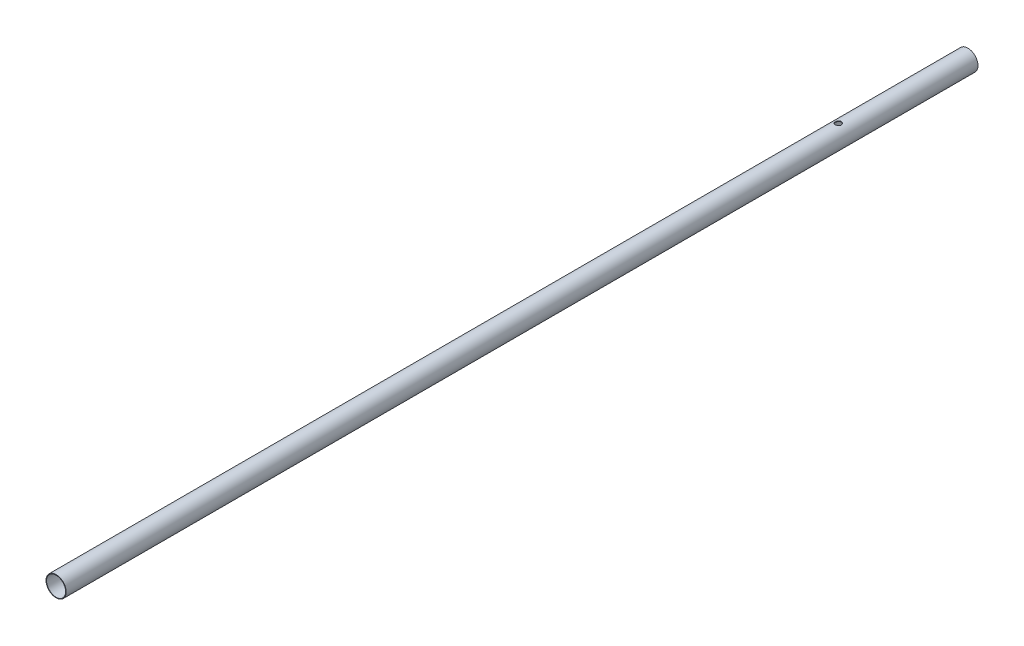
ISO-10303-21;
HEADER;
FILE_DESCRIPTION(('STEP AP214'),'2;1');
FILE_NAME('part.step','',(''),(''),'','','');
FILE_SCHEMA(('AUTOMOTIVE_DESIGN { 1 0 10303 214 1 1 1 1 }'));
ENDSEC;
DATA;
#1=APPLICATION_CONTEXT('core data for automotive mechanical design processes');
#2=APPLICATION_PROTOCOL_DEFINITION('international standard','automotive_design',2000,#1);
#3=PRODUCT_CONTEXT('',#1,'mechanical');
#4=PRODUCT('Part','Part','',(#3));
#5=PRODUCT_RELATED_PRODUCT_CATEGORY('part','',(#4));
#6=PRODUCT_DEFINITION_FORMATION('','',#4);
#7=PRODUCT_DEFINITION_CONTEXT('part definition',#1,'design');
#8=PRODUCT_DEFINITION('design','',#6,#7);
#9=PRODUCT_DEFINITION_SHAPE('','',#8);
#10=(LENGTH_UNIT() NAMED_UNIT(*) SI_UNIT(.MILLI.,.METRE.));
#11=(NAMED_UNIT(*) PLANE_ANGLE_UNIT() SI_UNIT($,.RADIAN.));
#12=(NAMED_UNIT(*) SI_UNIT($,.STERADIAN.) SOLID_ANGLE_UNIT());
#13=UNCERTAINTY_MEASURE_WITH_UNIT(LENGTH_MEASURE(1.E-05),#10,'distance_accuracy_value','');
#14=(GEOMETRIC_REPRESENTATION_CONTEXT(3) GLOBAL_UNCERTAINTY_ASSIGNED_CONTEXT((#13)) GLOBAL_UNIT_ASSIGNED_CONTEXT((#10,
#11,#12)) REPRESENTATION_CONTEXT('',''));
#15=CARTESIAN_POINT('',(0.,0.,0.));
#16=DIRECTION('',(0.,0.,1.));
#17=DIRECTION('',(1.,0.,0.));
#18=AXIS2_PLACEMENT_3D('',#15,#16,#17);
#19=CARTESIAN_POINT('',(0.,0.,1532.));
#20=DIRECTION('',(0.,0.,-1.));
#21=DIRECTION('',(-1.,0.,0.));
#22=AXIS2_PLACEMENT_3D('',#19,#20,#21);
#23=CYLINDRICAL_SURFACE('',#22,17.);
#24=CARTESIAN_POINT('',(0.,-17.,223.));
#25=CARTESIAN_POINT('',(0.274542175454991,-16.9999972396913,222.999996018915));
#26=CARTESIAN_POINT('',(0.549124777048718,-16.9932854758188,222.977312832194));
#27=CARTESIAN_POINT('',(1.09030958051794,-16.9671658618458,222.887384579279));
#28=CARTESIAN_POINT('',(1.35690910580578,-16.9477538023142,222.820124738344));
#29=CARTESIAN_POINT('',(1.87424279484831,-16.8983635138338,222.643471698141));
#30=CARTESIAN_POINT('',(2.12499922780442,-16.8684005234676,222.534139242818));
#31=CARTESIAN_POINT('',(2.60462027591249,-16.8010321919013,222.276689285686));
#32=CARTESIAN_POINT('',(2.83348222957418,-16.7636259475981,222.128567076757));
#33=CARTESIAN_POINT('',(3.26915832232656,-16.6842112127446,221.793416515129));
#34=CARTESIAN_POINT('',(3.47528005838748,-16.6421111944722,221.605509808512));
#35=CARTESIAN_POINT('',(3.85358695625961,-16.558607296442,221.197997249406));
#36=CARTESIAN_POINT('',(4.02576667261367,-16.5172035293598,220.978386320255));
#37=CARTESIAN_POINT('',(4.33489560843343,-16.4388177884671,220.507902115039));
#38=CARTESIAN_POINT('',(4.47100870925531,-16.4019498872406,220.256458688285));
#39=CARTESIAN_POINT('',(4.69873934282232,-16.3381741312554,219.732992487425));
#40=CARTESIAN_POINT('',(4.79036709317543,-16.3112639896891,219.460974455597));
#41=CARTESIAN_POINT('',(4.92404618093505,-16.2714028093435,218.911837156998));
#42=CARTESIAN_POINT('',(4.96737026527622,-16.2580942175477,218.635054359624));
#43=CARTESIAN_POINT('',(5.0071854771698,-16.245878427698,218.077853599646));
#44=CARTESIAN_POINT('',(5.00368745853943,-16.2469678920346,217.797436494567));
#45=CARTESIAN_POINT('',(4.95095940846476,-16.2631076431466,217.251198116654));
#46=CARTESIAN_POINT('',(4.90331354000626,-16.2776742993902,216.985207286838));
#47=CARTESIAN_POINT('',(4.76619765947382,-16.3183462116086,216.465174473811));
#48=CARTESIAN_POINT('',(4.67672366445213,-16.3444525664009,216.211133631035));
#49=CARTESIAN_POINT('',(4.45730211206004,-16.4056554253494,215.718290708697));
#50=CARTESIAN_POINT('',(4.32683320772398,-16.4408666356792,215.479735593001));
#51=CARTESIAN_POINT('',(4.02948792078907,-16.5162554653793,215.02736924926));
#52=CARTESIAN_POINT('',(3.86260301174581,-16.5564342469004,214.813563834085));
#53=CARTESIAN_POINT('',(3.48925235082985,-16.6392021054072,214.407768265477));
#54=CARTESIAN_POINT('',(3.28146894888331,-16.6818232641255,214.216994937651));
#55=CARTESIAN_POINT('',(2.83632910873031,-16.7632443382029,213.87272397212));
#56=CARTESIAN_POINT('',(2.59897095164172,-16.8020440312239,213.719228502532));
#57=CARTESIAN_POINT('',(2.09926848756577,-16.8717818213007,213.453169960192));
#58=CARTESIAN_POINT('',(1.83677785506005,-16.9026694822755,213.340867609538));
#59=CARTESIAN_POINT('',(1.29551766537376,-16.9527396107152,213.16235794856));
#60=CARTESIAN_POINT('',(1.01675248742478,-16.9719252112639,213.096138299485));
#61=CARTESIAN_POINT('',(0.461208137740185,-16.9959379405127,213.013678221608));
#62=CARTESIAN_POINT('',(0.184693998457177,-17.0012389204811,212.995787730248));
#63=CARTESIAN_POINT('',(-0.367399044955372,-16.9982701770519,213.005881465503));
#64=CARTESIAN_POINT('',(-0.642978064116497,-16.9900021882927,213.033859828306));
#65=CARTESIAN_POINT('',(-1.17921271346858,-16.961134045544,213.1335588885));
#66=CARTESIAN_POINT('',(-1.44006199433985,-16.9408036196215,213.204323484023));
#67=CARTESIAN_POINT('',(-1.9461351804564,-16.8901536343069,213.386443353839));
#68=CARTESIAN_POINT('',(-2.19135723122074,-16.8598328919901,213.497803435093));
#69=CARTESIAN_POINT('',(-2.66534944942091,-16.7915033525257,213.760775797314));
#70=CARTESIAN_POINT('',(-2.89362448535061,-16.7533367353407,213.913238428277));
#71=CARTESIAN_POINT('',(-3.32191560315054,-16.673704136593,214.253048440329));
#72=CARTESIAN_POINT('',(-3.52192485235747,-16.6322373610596,214.440404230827));
#73=CARTESIAN_POINT('',(-3.89521688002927,-16.5488725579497,214.852428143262));
#74=CARTESIAN_POINT('',(-4.06732704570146,-16.5070097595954,215.078168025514));
#75=CARTESIAN_POINT('',(-4.37129517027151,-16.4291353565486,215.556232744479));
#76=CARTESIAN_POINT('',(-4.50315434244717,-16.3931235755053,215.808556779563));
#77=CARTESIAN_POINT('',(-4.72194711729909,-16.3314467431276,216.331714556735));
#78=CARTESIAN_POINT('',(-4.80910325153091,-16.3057305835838,216.60244886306));
#79=CARTESIAN_POINT('',(-4.93634927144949,-16.26766584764,217.155642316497));
#80=CARTESIAN_POINT('',(-4.97645449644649,-16.2553129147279,217.438097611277));
#81=CARTESIAN_POINT('',(-5.00744547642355,-16.2457908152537,217.994567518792));
#82=CARTESIAN_POINT('',(-5.00023747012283,-16.2480335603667,218.268467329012));
#83=CARTESIAN_POINT('',(-4.94133317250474,-16.2660429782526,218.810964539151));
#84=CARTESIAN_POINT('',(-4.88963853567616,-16.2818091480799,219.079562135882));
#85=CARTESIAN_POINT('',(-4.74443717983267,-16.3247022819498,219.600847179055));
#86=CARTESIAN_POINT('',(-4.65141659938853,-16.3516969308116,219.853681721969));
#87=CARTESIAN_POINT('',(-4.42658103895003,-16.413985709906,220.340356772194));
#88=CARTESIAN_POINT('',(-4.2947588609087,-16.4492813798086,220.574193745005));
#89=CARTESIAN_POINT('',(-3.99063021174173,-16.525744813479,221.025129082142));
#90=CARTESIAN_POINT('',(-3.81706300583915,-16.5670754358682,221.241349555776));
#91=CARTESIAN_POINT('',(-3.43666397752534,-16.6501406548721,221.642213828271));
#92=CARTESIAN_POINT('',(-3.22982363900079,-16.6918753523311,221.826849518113));
#93=CARTESIAN_POINT('',(-2.78184131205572,-16.7724327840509,222.164392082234));
#94=CARTESIAN_POINT('',(-2.53990743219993,-16.8111427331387,222.316277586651));
#95=CARTESIAN_POINT('',(-2.03279874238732,-16.8799593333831,222.576998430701));
#96=CARTESIAN_POINT('',(-1.76763565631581,-16.9100702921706,222.685855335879));
#97=CARTESIAN_POINT('',(-1.25377523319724,-16.9554297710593,222.846835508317));
#98=CARTESIAN_POINT('',(-1.00680227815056,-16.97200860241,222.90412084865));
#99=CARTESIAN_POINT('',(-0.506563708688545,-16.9942941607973,222.980702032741));
#100=CARTESIAN_POINT('',(-0.253299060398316,-17.0000025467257,223.000003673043));
#101=CARTESIAN_POINT('',(0.,-17.,223.));
#102=B_SPLINE_CURVE_WITH_KNOTS('',3,(#24,#25,#26,#27,#28,#29,#30,#31,#32,#33,#34,#35,#36,#37,
#38,#39,#40,#41,#42,#43,#44,#45,#46,#47,#48,#49,#50,#51,#52,#53,#54,#55,#56,#57,#58,#59,#60,#61,
#62,#63,#64,#65,#66,#67,#68,#69,#70,#71,#72,#73,#74,#75,#76,#77,#78,#79,#80,#81,#82,#83,#84,#85,
#86,#87,#88,#89,#90,#91,#92,#93,#94,#95,#96,#97,#98,#99,#100,#101),.UNSPECIFIED.,.T.,.F.,(4,2,2,
2,2,2,2,2,2,2,2,2,2,2,2,2,2,2,2,2,2,2,2,2,2,2,2,2,2,2,2,2,2,2,2,2,2,2,4),(0.,0.822696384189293,
1.64566558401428,2.46745102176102,3.28933622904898,4.13172361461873,4.97424603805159,
5.83486437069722,6.69528493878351,7.53245524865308,8.36943149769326,9.17749119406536,
9.98562785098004,10.8044888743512,11.623541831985,12.4754016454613,13.3273109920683,
14.18452287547,15.0415051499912,15.8688347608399,16.6960586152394,17.5054473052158,
18.3149318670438,19.1426539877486,19.9705758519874,20.8273157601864,21.6840298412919,
22.5364367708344,23.3885657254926,24.2065793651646,25.024562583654,25.8331682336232,
26.6419239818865,27.4791225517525,28.3165357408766,29.1771614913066,30.0373553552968,
30.7965102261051,31.5555492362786),.UNSPECIFIED.);
#103=CARTESIAN_POINT('',(0.,-17.,223.));
#104=VERTEX_POINT('',#103);
#105=EDGE_CURVE('E72',#104,#104,#102,.T.);
#106=ORIENTED_EDGE('',*,*,#105,.T.);
#107=EDGE_LOOP('',(#106));
#108=FACE_BOUND('',#107,.T.);
#109=CARTESIAN_POINT('',(0.,17.,223.));
#110=CARTESIAN_POINT('',(-0.274542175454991,16.9999972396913,222.999996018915));
#111=CARTESIAN_POINT('',(-0.549124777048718,16.9932854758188,222.977312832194));
#112=CARTESIAN_POINT('',(-1.09030958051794,16.9671658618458,222.887384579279));
#113=CARTESIAN_POINT('',(-1.35690910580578,16.9477538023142,222.820124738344));
#114=CARTESIAN_POINT('',(-1.87424279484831,16.8983635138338,222.643471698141));
#115=CARTESIAN_POINT('',(-2.12499922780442,16.8684005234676,222.534139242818));
#116=CARTESIAN_POINT('',(-2.60462027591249,16.8010321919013,222.276689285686));
#117=CARTESIAN_POINT('',(-2.83348222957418,16.7636259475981,222.128567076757));
#118=CARTESIAN_POINT('',(-3.26915832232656,16.6842112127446,221.793416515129));
#119=CARTESIAN_POINT('',(-3.47528005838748,16.6421111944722,221.605509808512));
#120=CARTESIAN_POINT('',(-3.85358695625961,16.558607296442,221.197997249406));
#121=CARTESIAN_POINT('',(-4.02576667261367,16.5172035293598,220.978386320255));
#122=CARTESIAN_POINT('',(-4.33489560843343,16.4388177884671,220.507902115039));
#123=CARTESIAN_POINT('',(-4.47100870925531,16.4019498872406,220.256458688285));
#124=CARTESIAN_POINT('',(-4.69873934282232,16.3381741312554,219.732992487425));
#125=CARTESIAN_POINT('',(-4.79036709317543,16.3112639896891,219.460974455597));
#126=CARTESIAN_POINT('',(-4.92404618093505,16.2714028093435,218.911837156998));
#127=CARTESIAN_POINT('',(-4.96737026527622,16.2580942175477,218.635054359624));
#128=CARTESIAN_POINT('',(-5.0071854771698,16.245878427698,218.077853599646));
#129=CARTESIAN_POINT('',(-5.00368745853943,16.2469678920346,217.797436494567));
#130=CARTESIAN_POINT('',(-4.95095940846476,16.2631076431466,217.251198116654));
#131=CARTESIAN_POINT('',(-4.90331354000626,16.2776742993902,216.985207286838));
#132=CARTESIAN_POINT('',(-4.76619765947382,16.3183462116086,216.465174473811));
#133=CARTESIAN_POINT('',(-4.67672366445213,16.3444525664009,216.211133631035));
#134=CARTESIAN_POINT('',(-4.45730211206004,16.4056554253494,215.718290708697));
#135=CARTESIAN_POINT('',(-4.32683320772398,16.4408666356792,215.479735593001));
#136=CARTESIAN_POINT('',(-4.02948792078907,16.5162554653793,215.02736924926));
#137=CARTESIAN_POINT('',(-3.86260301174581,16.5564342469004,214.813563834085));
#138=CARTESIAN_POINT('',(-3.48925235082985,16.6392021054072,214.407768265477));
#139=CARTESIAN_POINT('',(-3.28146894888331,16.6818232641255,214.216994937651));
#140=CARTESIAN_POINT('',(-2.83632910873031,16.7632443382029,213.87272397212));
#141=CARTESIAN_POINT('',(-2.59897095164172,16.8020440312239,213.719228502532));
#142=CARTESIAN_POINT('',(-2.09926848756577,16.8717818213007,213.453169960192));
#143=CARTESIAN_POINT('',(-1.83677785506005,16.9026694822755,213.340867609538));
#144=CARTESIAN_POINT('',(-1.29551766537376,16.9527396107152,213.16235794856));
#145=CARTESIAN_POINT('',(-1.01675248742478,16.9719252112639,213.096138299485));
#146=CARTESIAN_POINT('',(-0.461208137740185,16.9959379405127,213.013678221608));
#147=CARTESIAN_POINT('',(-0.184693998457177,17.0012389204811,212.995787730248));
#148=CARTESIAN_POINT('',(0.367399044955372,16.9982701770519,213.005881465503));
#149=CARTESIAN_POINT('',(0.642978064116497,16.9900021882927,213.033859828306));
#150=CARTESIAN_POINT('',(1.17921271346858,16.961134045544,213.1335588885));
#151=CARTESIAN_POINT('',(1.44006199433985,16.9408036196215,213.204323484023));
#152=CARTESIAN_POINT('',(1.9461351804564,16.8901536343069,213.386443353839));
#153=CARTESIAN_POINT('',(2.19135723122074,16.8598328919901,213.497803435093));
#154=CARTESIAN_POINT('',(2.66534944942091,16.7915033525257,213.760775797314));
#155=CARTESIAN_POINT('',(2.89362448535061,16.7533367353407,213.913238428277));
#156=CARTESIAN_POINT('',(3.32191560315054,16.673704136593,214.253048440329));
#157=CARTESIAN_POINT('',(3.52192485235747,16.6322373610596,214.440404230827));
#158=CARTESIAN_POINT('',(3.89521688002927,16.5488725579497,214.852428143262));
#159=CARTESIAN_POINT('',(4.06732704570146,16.5070097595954,215.078168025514));
#160=CARTESIAN_POINT('',(4.37129517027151,16.4291353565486,215.556232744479));
#161=CARTESIAN_POINT('',(4.50315434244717,16.3931235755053,215.808556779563));
#162=CARTESIAN_POINT('',(4.72194711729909,16.3314467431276,216.331714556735));
#163=CARTESIAN_POINT('',(4.80910325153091,16.3057305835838,216.60244886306));
#164=CARTESIAN_POINT('',(4.93634927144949,16.26766584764,217.155642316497));
#165=CARTESIAN_POINT('',(4.97645449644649,16.2553129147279,217.438097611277));
#166=CARTESIAN_POINT('',(5.00744547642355,16.2457908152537,217.994567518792));
#167=CARTESIAN_POINT('',(5.00023747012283,16.2480335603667,218.268467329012));
#168=CARTESIAN_POINT('',(4.94133317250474,16.2660429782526,218.810964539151));
#169=CARTESIAN_POINT('',(4.88963853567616,16.2818091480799,219.079562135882));
#170=CARTESIAN_POINT('',(4.74443717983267,16.3247022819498,219.600847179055));
#171=CARTESIAN_POINT('',(4.65141659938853,16.3516969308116,219.853681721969));
#172=CARTESIAN_POINT('',(4.42658103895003,16.413985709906,220.340356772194));
#173=CARTESIAN_POINT('',(4.2947588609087,16.4492813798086,220.574193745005));
#174=CARTESIAN_POINT('',(3.99063021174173,16.525744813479,221.025129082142));
#175=CARTESIAN_POINT('',(3.81706300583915,16.5670754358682,221.241349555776));
#176=CARTESIAN_POINT('',(3.43666397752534,16.6501406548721,221.642213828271));
#177=CARTESIAN_POINT('',(3.22982363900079,16.6918753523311,221.826849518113));
#178=CARTESIAN_POINT('',(2.78184131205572,16.7724327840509,222.164392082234));
#179=CARTESIAN_POINT('',(2.53990743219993,16.8111427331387,222.316277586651));
#180=CARTESIAN_POINT('',(2.03279874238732,16.8799593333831,222.576998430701));
#181=CARTESIAN_POINT('',(1.76763565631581,16.9100702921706,222.685855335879));
#182=CARTESIAN_POINT('',(1.25377523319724,16.9554297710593,222.846835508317));
#183=CARTESIAN_POINT('',(1.00680227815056,16.97200860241,222.90412084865));
#184=CARTESIAN_POINT('',(0.506563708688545,16.9942941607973,222.980702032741));
#185=CARTESIAN_POINT('',(0.253299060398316,17.0000025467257,223.000003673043));
#186=CARTESIAN_POINT('',(0.,17.,223.));
#187=B_SPLINE_CURVE_WITH_KNOTS('',3,(#109,#110,#111,#112,#113,#114,#115,#116,#117,#118,#119,
#120,#121,#122,#123,#124,#125,#126,#127,#128,#129,#130,#131,#132,#133,#134,#135,#136,#137,#138,
#139,#140,#141,#142,#143,#144,#145,#146,#147,#148,#149,#150,#151,#152,#153,#154,#155,#156,#157,
#158,#159,#160,#161,#162,#163,#164,#165,#166,#167,#168,#169,#170,#171,#172,#173,#174,#175,#176,
#177,#178,#179,#180,#181,#182,#183,#184,#185,#186),.UNSPECIFIED.,.T.,.F.,(4,2,2,2,2,2,2,2,2,2,2,
2,2,2,2,2,2,2,2,2,2,2,2,2,2,2,2,2,2,2,2,2,2,2,2,2,2,2,4),(0.,0.822696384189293,1.64566558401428,
2.46745102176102,3.28933622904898,4.13172361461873,4.97424603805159,5.83486437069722,
6.69528493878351,7.53245524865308,8.36943149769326,9.17749119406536,9.98562785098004,
10.8044888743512,11.623541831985,12.4754016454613,13.3273109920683,14.18452287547,
15.0415051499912,15.8688347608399,16.6960586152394,17.5054473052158,18.3149318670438,
19.1426539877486,19.9705758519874,20.8273157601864,21.6840298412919,22.5364367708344,
23.3885657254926,24.2065793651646,25.024562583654,25.8331682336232,26.6419239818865,
27.4791225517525,28.3165357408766,29.1771614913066,30.0373553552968,30.7965102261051,
31.5555492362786),.UNSPECIFIED.);
#188=CARTESIAN_POINT('',(0.,17.,223.));
#189=VERTEX_POINT('',#188);
#190=EDGE_CURVE('E68',#189,#189,#187,.T.);
#191=ORIENTED_EDGE('',*,*,#190,.T.);
#192=EDGE_LOOP('',(#191));
#193=FACE_BOUND('',#192,.T.);
#194=CARTESIAN_POINT('',(0.,0.,1532.));
#195=DIRECTION('',(0.,0.,1.));
#196=DIRECTION('',(1.,0.,0.));
#197=AXIS2_PLACEMENT_3D('',#194,#195,#196);
#198=CIRCLE('',#197,17.);
#199=CARTESIAN_POINT('',(17.,0.,1532.));
#200=VERTEX_POINT('',#199);
#201=EDGE_CURVE('E10',#200,#200,#198,.T.);
#202=ORIENTED_EDGE('',*,*,#201,.F.);
#203=EDGE_LOOP('',(#202));
#204=FACE_BOUND('',#203,.T.);
#205=CARTESIAN_POINT('',(0.,0.,0.));
#206=DIRECTION('',(0.,0.,1.));
#207=DIRECTION('',(1.,0.,0.));
#208=AXIS2_PLACEMENT_3D('',#205,#206,#207);
#209=CIRCLE('',#208,17.);
#210=CARTESIAN_POINT('',(17.,0.,0.));
#211=VERTEX_POINT('',#210);
#212=EDGE_CURVE('E41',#211,#211,#209,.T.);
#213=ORIENTED_EDGE('',*,*,#212,.T.);
#214=EDGE_LOOP('',(#213));
#215=FACE_BOUND('',#214,.T.);
#216=ADVANCED_FACE('F29',(#108,#193,#204,#215),#23,.T.);
#217=CARTESIAN_POINT('',(0.,0.,1532.));
#218=DIRECTION('',(0.,0.,1.));
#219=DIRECTION('',(1.,0.,0.));
#220=AXIS2_PLACEMENT_3D('',#217,#218,#219);
#221=PLANE('',#220);
#222=CARTESIAN_POINT('',(0.,0.,1532.));
#223=DIRECTION('',(0.,0.,1.));
#224=DIRECTION('',(1.,0.,0.));
#225=AXIS2_PLACEMENT_3D('',#222,#223,#224);
#226=CIRCLE('',#225,16.);
#227=CARTESIAN_POINT('',(16.,0.,1532.));
#228=VERTEX_POINT('',#227);
#229=EDGE_CURVE('E49',#228,#228,#226,.T.);
#230=ORIENTED_EDGE('',*,*,#229,.F.);
#231=EDGE_LOOP('',(#230));
#232=FACE_BOUND('',#231,.T.);
#233=ORIENTED_EDGE('',*,*,#201,.T.);
#234=EDGE_LOOP('',(#233));
#235=FACE_BOUND('',#234,.T.);
#236=ADVANCED_FACE('F83',(#232,#235),#221,.T.);
#237=CARTESIAN_POINT('',(0.,0.,0.));
#238=DIRECTION('',(0.,0.,1.));
#239=DIRECTION('',(1.,0.,0.));
#240=AXIS2_PLACEMENT_3D('',#237,#238,#239);
#241=PLANE('',#240);
#242=CARTESIAN_POINT('',(0.,0.,0.));
#243=DIRECTION('',(0.,0.,1.));
#244=DIRECTION('',(1.,0.,0.));
#245=AXIS2_PLACEMENT_3D('',#242,#243,#244);
#246=CIRCLE('',#245,16.);
#247=CARTESIAN_POINT('',(16.,0.,0.));
#248=VERTEX_POINT('',#247);
#249=EDGE_CURVE('E46',#248,#248,#246,.T.);
#250=ORIENTED_EDGE('',*,*,#249,.T.);
#251=EDGE_LOOP('',(#250));
#252=FACE_BOUND('',#251,.T.);
#253=ORIENTED_EDGE('',*,*,#212,.F.);
#254=EDGE_LOOP('',(#253));
#255=FACE_BOUND('',#254,.T.);
#256=ADVANCED_FACE('F85',(#252,#255),#241,.F.);
#257=CARTESIAN_POINT('',(0.,0.,0.));
#258=DIRECTION('',(0.,0.,1.));
#259=DIRECTION('',(1.,0.,0.));
#260=AXIS2_PLACEMENT_3D('',#257,#258,#259);
#261=CYLINDRICAL_SURFACE('',#260,16.);
#262=CARTESIAN_POINT('',(0.,-16.,223.));
#263=CARTESIAN_POINT('',(-0.273756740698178,-15.9999986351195,222.99999821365));
#264=CARTESIAN_POINT('',(-0.547532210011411,-15.9929077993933,222.977443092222));
#265=CARTESIAN_POINT('',(-1.08707683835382,-15.9653157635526,222.888055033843));
#266=CARTESIAN_POINT('',(-1.35284417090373,-15.9448115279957,222.821212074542));
#267=CARTESIAN_POINT('',(-1.86851417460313,-15.892632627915,222.645722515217));
#268=CARTESIAN_POINT('',(-2.11844070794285,-15.860975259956,222.537140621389));
#269=CARTESIAN_POINT('',(-2.59653920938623,-15.7897587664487,222.281530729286));
#270=CARTESIAN_POINT('',(-2.82470774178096,-15.7501983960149,222.134496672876));
#271=CARTESIAN_POINT('',(-3.25986133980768,-15.6660085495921,221.801376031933));
#272=CARTESIAN_POINT('',(-3.46608011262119,-15.621268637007,221.614316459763));
#273=CARTESIAN_POINT('',(-3.84478952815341,-15.5324018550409,221.208526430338));
#274=CARTESIAN_POINT('',(-4.01727389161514,-15.4882751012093,220.989790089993));
#275=CARTESIAN_POINT('',(-4.32777345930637,-15.4044457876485,220.520221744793));
#276=CARTESIAN_POINT('',(-4.4648313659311,-15.3648795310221,220.268730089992));
#277=CARTESIAN_POINT('',(-4.69438964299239,-15.2963120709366,219.744830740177));
#278=CARTESIAN_POINT('',(-4.78690175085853,-15.2673080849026,219.472428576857));
#279=CARTESIAN_POINT('',(-4.92193839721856,-15.224304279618,218.923087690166));
#280=CARTESIAN_POINT('',(-4.96588440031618,-15.2098789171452,218.646532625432));
#281=CARTESIAN_POINT('',(-5.00698220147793,-15.1964022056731,218.089627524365));
#282=CARTESIAN_POINT('',(-5.00414643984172,-15.1973467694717,217.809278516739));
#283=CARTESIAN_POINT('',(-4.95287298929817,-15.2141275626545,217.264502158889));
#284=CARTESIAN_POINT('',(-4.90624231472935,-15.2293736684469,216.999883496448));
#285=CARTESIAN_POINT('',(-4.77163253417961,-15.272081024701,216.482431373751));
#286=CARTESIAN_POINT('',(-4.68364903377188,-15.2995435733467,216.229599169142));
#287=CARTESIAN_POINT('',(-4.46755498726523,-15.3640417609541,215.738592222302));
#288=CARTESIAN_POINT('',(-4.33887702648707,-15.4012113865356,215.500685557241));
#289=CARTESIAN_POINT('',(-4.04544082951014,-15.4808742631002,215.049248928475));
#290=CARTESIAN_POINT('',(-3.88067322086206,-15.523368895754,214.835725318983));
#291=CARTESIAN_POINT('',(-3.51086781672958,-15.6112611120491,214.428900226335));
#292=CARTESIAN_POINT('',(-3.30433828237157,-15.6567027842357,214.236961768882));
#293=CARTESIAN_POINT('',(-2.86145763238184,-15.7436628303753,213.890112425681));
#294=CARTESIAN_POINT('',(-2.62510430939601,-15.7851809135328,213.735204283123));
#295=CARTESIAN_POINT('',(-2.12665844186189,-15.8600517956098,213.465889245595));
#296=CARTESIAN_POINT('',(-1.86437962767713,-15.8933384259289,213.351807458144));
#297=CARTESIAN_POINT('',(-1.32307191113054,-15.9475182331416,213.169787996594));
#298=CARTESIAN_POINT('',(-1.04404812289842,-15.9684151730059,213.101836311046));
#299=CARTESIAN_POINT('',(-0.488740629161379,-15.9948555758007,213.016327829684));
#300=CARTESIAN_POINT('',(-0.212767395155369,-16.0009609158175,212.996925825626));
#301=CARTESIAN_POINT('',(0.338521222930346,-15.9987919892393,213.003864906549));
#302=CARTESIAN_POINT('',(0.613836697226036,-15.9905198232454,213.03019930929));
#303=CARTESIAN_POINT('',(1.1488773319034,-15.9608945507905,213.126382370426));
#304=CARTESIAN_POINT('',(1.40881991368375,-15.9398717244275,213.19513307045));
#305=CARTESIAN_POINT('',(1.91340771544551,-15.8872048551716,213.372857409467));
#306=CARTESIAN_POINT('',(2.15805104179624,-15.8555595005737,213.4818360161));
#307=CARTESIAN_POINT('',(2.63172962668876,-15.783941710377,213.739892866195));
#308=CARTESIAN_POINT('',(2.86023895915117,-15.7437850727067,213.889883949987));
#309=CARTESIAN_POINT('',(3.28946340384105,-15.6597364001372,214.22461284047));
#310=CARTESIAN_POINT('',(3.4901709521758,-15.6158433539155,214.409360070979));
#311=CARTESIAN_POINT('',(3.86634985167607,-15.5270797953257,214.817035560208));
#312=CARTESIAN_POINT('',(4.04050609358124,-15.4822394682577,215.041186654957));
#313=CARTESIAN_POINT('',(4.34885000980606,-15.3984778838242,215.516506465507));
#314=CARTESIAN_POINT('',(4.48303831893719,-15.3595565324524,215.767674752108));
#315=CARTESIAN_POINT('',(4.7068033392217,-15.2924712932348,216.289380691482));
#316=CARTESIAN_POINT('',(4.7965527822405,-15.264265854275,216.559838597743));
#317=CARTESIAN_POINT('',(4.92891577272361,-15.2220468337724,217.113089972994));
#318=CARTESIAN_POINT('',(4.97154725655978,-15.2080278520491,217.395878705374));
#319=CARTESIAN_POINT('',(5.00717624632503,-15.1963317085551,217.952016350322));
#320=CARTESIAN_POINT('',(5.00233118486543,-15.1979441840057,218.22521381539));
#321=CARTESIAN_POINT('',(4.94835272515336,-15.2156036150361,218.766698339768));
#322=CARTESIAN_POINT('',(4.89922139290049,-15.2316498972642,219.034985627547));
#323=CARTESIAN_POINT('',(4.7595091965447,-15.2758725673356,219.555176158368));
#324=CARTESIAN_POINT('',(4.66954569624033,-15.3038679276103,219.807261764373));
#325=CARTESIAN_POINT('',(4.45120909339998,-15.3687881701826,220.292961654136));
#326=CARTESIAN_POINT('',(4.32282817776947,-15.4057148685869,220.526572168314));
#327=CARTESIAN_POINT('',(4.02542700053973,-15.4861394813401,220.978583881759));
#328=CARTESIAN_POINT('',(3.85501334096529,-15.5298379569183,221.196032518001));
#329=CARTESIAN_POINT('',(3.4808359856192,-15.6179599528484,221.599945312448));
#330=CARTESIAN_POINT('',(3.27706336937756,-15.6623836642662,221.786401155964));
#331=CARTESIAN_POINT('',(2.83394665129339,-15.7486908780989,222.129130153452));
#332=CARTESIAN_POINT('',(2.59365829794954,-15.7904440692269,222.2842189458));
#333=CARTESIAN_POINT('',(2.08911655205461,-15.8650707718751,222.551595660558));
#334=CARTESIAN_POINT('',(1.82487263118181,-15.8979477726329,222.663900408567));
#335=CARTESIAN_POINT('',(1.30299054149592,-15.9488260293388,222.834365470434));
#336=CARTESIAN_POINT('',(1.04668134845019,-15.9678496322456,222.896299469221));
#337=CARTESIAN_POINT('',(0.526919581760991,-15.9934360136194,222.979113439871));
#338=CARTESIAN_POINT('',(0.263468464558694,-16.0000013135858,223.000001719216));
#339=CARTESIAN_POINT('',(0.,-16.,223.));
#340=B_SPLINE_CURVE_WITH_KNOTS('',3,(#262,#263,#264,#265,#266,#267,#268,#269,#270,#271,#272,
#273,#274,#275,#276,#277,#278,#279,#280,#281,#282,#283,#284,#285,#286,#287,#288,#289,#290,#291,
#292,#293,#294,#295,#296,#297,#298,#299,#300,#301,#302,#303,#304,#305,#306,#307,#308,#309,#310,
#311,#312,#313,#314,#315,#316,#317,#318,#319,#320,#321,#322,#323,#324,#325,#326,#327,#328,#329,
#330,#331,#332,#333,#334,#335,#336,#337,#338,#339),.UNSPECIFIED.,.T.,.F.,(4,2,2,2,2,2,2,2,2,2,2,
2,2,2,2,2,2,2,2,2,2,2,2,2,2,2,2,2,2,2,2,2,2,2,2,2,2,2,4),(0.,0.820301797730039,1.64078929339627,
2.46000991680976,3.27935968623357,4.12151288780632,4.96382269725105,5.82695084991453,
6.68985145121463,7.52676600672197,8.3634580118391,9.16707669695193,9.97078079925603,
10.7862257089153,11.6018826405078,12.4546698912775,13.3075202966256,14.1670184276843,
15.0262553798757,15.852302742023,16.678229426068,17.4836250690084,18.2891202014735,
19.1142529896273,19.9396098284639,20.7976711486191,21.655718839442,22.5104046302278,
23.3647649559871,24.1804881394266,24.9961732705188,25.7999165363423,26.6038233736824,
27.4391805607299,28.274761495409,29.1376267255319,30.0001522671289,30.7897854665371,
31.5792588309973),.UNSPECIFIED.);
#341=CARTESIAN_POINT('',(0.,-16.,223.));
#342=VERTEX_POINT('',#341);
#343=EDGE_CURVE('E33',#342,#342,#340,.T.);
#344=ORIENTED_EDGE('',*,*,#343,.T.);
#345=EDGE_LOOP('',(#344));
#346=FACE_BOUND('',#345,.T.);
#347=CARTESIAN_POINT('',(0.,16.,223.));
#348=CARTESIAN_POINT('',(0.273756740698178,15.9999986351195,222.99999821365));
#349=CARTESIAN_POINT('',(0.547532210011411,15.9929077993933,222.977443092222));
#350=CARTESIAN_POINT('',(1.08707683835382,15.9653157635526,222.888055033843));
#351=CARTESIAN_POINT('',(1.35284417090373,15.9448115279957,222.821212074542));
#352=CARTESIAN_POINT('',(1.86851417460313,15.892632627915,222.645722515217));
#353=CARTESIAN_POINT('',(2.11844070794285,15.860975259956,222.537140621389));
#354=CARTESIAN_POINT('',(2.59653920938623,15.7897587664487,222.281530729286));
#355=CARTESIAN_POINT('',(2.82470774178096,15.7501983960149,222.134496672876));
#356=CARTESIAN_POINT('',(3.25986133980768,15.6660085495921,221.801376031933));
#357=CARTESIAN_POINT('',(3.46608011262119,15.621268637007,221.614316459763));
#358=CARTESIAN_POINT('',(3.84478952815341,15.5324018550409,221.208526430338));
#359=CARTESIAN_POINT('',(4.01727389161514,15.4882751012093,220.989790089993));
#360=CARTESIAN_POINT('',(4.32777345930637,15.4044457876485,220.520221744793));
#361=CARTESIAN_POINT('',(4.4648313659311,15.3648795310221,220.268730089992));
#362=CARTESIAN_POINT('',(4.69438964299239,15.2963120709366,219.744830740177));
#363=CARTESIAN_POINT('',(4.78690175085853,15.2673080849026,219.472428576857));
#364=CARTESIAN_POINT('',(4.92193839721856,15.224304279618,218.923087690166));
#365=CARTESIAN_POINT('',(4.96588440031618,15.2098789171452,218.646532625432));
#366=CARTESIAN_POINT('',(5.00698220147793,15.1964022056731,218.089627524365));
#367=CARTESIAN_POINT('',(5.00414643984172,15.1973467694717,217.809278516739));
#368=CARTESIAN_POINT('',(4.95287298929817,15.2141275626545,217.264502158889));
#369=CARTESIAN_POINT('',(4.90624231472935,15.2293736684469,216.999883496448));
#370=CARTESIAN_POINT('',(4.77163253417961,15.272081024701,216.482431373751));
#371=CARTESIAN_POINT('',(4.68364903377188,15.2995435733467,216.229599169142));
#372=CARTESIAN_POINT('',(4.46755498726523,15.3640417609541,215.738592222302));
#373=CARTESIAN_POINT('',(4.33887702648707,15.4012113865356,215.500685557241));
#374=CARTESIAN_POINT('',(4.04544082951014,15.4808742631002,215.049248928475));
#375=CARTESIAN_POINT('',(3.88067322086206,15.523368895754,214.835725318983));
#376=CARTESIAN_POINT('',(3.51086781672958,15.6112611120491,214.428900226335));
#377=CARTESIAN_POINT('',(3.30433828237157,15.6567027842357,214.236961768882));
#378=CARTESIAN_POINT('',(2.86145763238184,15.7436628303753,213.890112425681));
#379=CARTESIAN_POINT('',(2.62510430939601,15.7851809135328,213.735204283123));
#380=CARTESIAN_POINT('',(2.12665844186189,15.8600517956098,213.465889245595));
#381=CARTESIAN_POINT('',(1.86437962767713,15.8933384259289,213.351807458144));
#382=CARTESIAN_POINT('',(1.32307191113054,15.9475182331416,213.169787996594));
#383=CARTESIAN_POINT('',(1.04404812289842,15.9684151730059,213.101836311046));
#384=CARTESIAN_POINT('',(0.488740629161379,15.9948555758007,213.016327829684));
#385=CARTESIAN_POINT('',(0.212767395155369,16.0009609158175,212.996925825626));
#386=CARTESIAN_POINT('',(-0.338521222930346,15.9987919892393,213.003864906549));
#387=CARTESIAN_POINT('',(-0.613836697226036,15.9905198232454,213.03019930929));
#388=CARTESIAN_POINT('',(-1.1488773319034,15.9608945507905,213.126382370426));
#389=CARTESIAN_POINT('',(-1.40881991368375,15.9398717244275,213.19513307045));
#390=CARTESIAN_POINT('',(-1.91340771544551,15.8872048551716,213.372857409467));
#391=CARTESIAN_POINT('',(-2.15805104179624,15.8555595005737,213.4818360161));
#392=CARTESIAN_POINT('',(-2.63172962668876,15.783941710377,213.739892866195));
#393=CARTESIAN_POINT('',(-2.86023895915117,15.7437850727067,213.889883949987));
#394=CARTESIAN_POINT('',(-3.28946340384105,15.6597364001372,214.22461284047));
#395=CARTESIAN_POINT('',(-3.4901709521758,15.6158433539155,214.409360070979));
#396=CARTESIAN_POINT('',(-3.86634985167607,15.5270797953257,214.817035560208));
#397=CARTESIAN_POINT('',(-4.04050609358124,15.4822394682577,215.041186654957));
#398=CARTESIAN_POINT('',(-4.34885000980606,15.3984778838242,215.516506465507));
#399=CARTESIAN_POINT('',(-4.48303831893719,15.3595565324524,215.767674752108));
#400=CARTESIAN_POINT('',(-4.7068033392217,15.2924712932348,216.289380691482));
#401=CARTESIAN_POINT('',(-4.7965527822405,15.264265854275,216.559838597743));
#402=CARTESIAN_POINT('',(-4.92891577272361,15.2220468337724,217.113089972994));
#403=CARTESIAN_POINT('',(-4.97154725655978,15.2080278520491,217.395878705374));
#404=CARTESIAN_POINT('',(-5.00717624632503,15.1963317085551,217.952016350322));
#405=CARTESIAN_POINT('',(-5.00233118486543,15.1979441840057,218.22521381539));
#406=CARTESIAN_POINT('',(-4.94835272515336,15.2156036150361,218.766698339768));
#407=CARTESIAN_POINT('',(-4.89922139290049,15.2316498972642,219.034985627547));
#408=CARTESIAN_POINT('',(-4.7595091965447,15.2758725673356,219.555176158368));
#409=CARTESIAN_POINT('',(-4.66954569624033,15.3038679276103,219.807261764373));
#410=CARTESIAN_POINT('',(-4.45120909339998,15.3687881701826,220.292961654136));
#411=CARTESIAN_POINT('',(-4.32282817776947,15.4057148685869,220.526572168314));
#412=CARTESIAN_POINT('',(-4.02542700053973,15.4861394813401,220.978583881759));
#413=CARTESIAN_POINT('',(-3.85501334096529,15.5298379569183,221.196032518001));
#414=CARTESIAN_POINT('',(-3.4808359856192,15.6179599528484,221.599945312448));
#415=CARTESIAN_POINT('',(-3.27706336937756,15.6623836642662,221.786401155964));
#416=CARTESIAN_POINT('',(-2.83394665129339,15.7486908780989,222.129130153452));
#417=CARTESIAN_POINT('',(-2.59365829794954,15.7904440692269,222.2842189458));
#418=CARTESIAN_POINT('',(-2.08911655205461,15.8650707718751,222.551595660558));
#419=CARTESIAN_POINT('',(-1.82487263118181,15.8979477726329,222.663900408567));
#420=CARTESIAN_POINT('',(-1.30299054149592,15.9488260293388,222.834365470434));
#421=CARTESIAN_POINT('',(-1.04668134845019,15.9678496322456,222.896299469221));
#422=CARTESIAN_POINT('',(-0.526919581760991,15.9934360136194,222.979113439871));
#423=CARTESIAN_POINT('',(-0.263468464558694,16.0000013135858,223.000001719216));
#424=CARTESIAN_POINT('',(0.,16.,223.));
#425=B_SPLINE_CURVE_WITH_KNOTS('',3,(#347,#348,#349,#350,#351,#352,#353,#354,#355,#356,#357,
#358,#359,#360,#361,#362,#363,#364,#365,#366,#367,#368,#369,#370,#371,#372,#373,#374,#375,#376,
#377,#378,#379,#380,#381,#382,#383,#384,#385,#386,#387,#388,#389,#390,#391,#392,#393,#394,#395,
#396,#397,#398,#399,#400,#401,#402,#403,#404,#405,#406,#407,#408,#409,#410,#411,#412,#413,#414,
#415,#416,#417,#418,#419,#420,#421,#422,#423,#424),.UNSPECIFIED.,.T.,.F.,(4,2,2,2,2,2,2,2,2,2,2,
2,2,2,2,2,2,2,2,2,2,2,2,2,2,2,2,2,2,2,2,2,2,2,2,2,2,2,4),(0.,0.820301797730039,1.64078929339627,
2.46000991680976,3.27935968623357,4.12151288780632,4.96382269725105,5.82695084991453,
6.68985145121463,7.52676600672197,8.3634580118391,9.16707669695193,9.97078079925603,
10.7862257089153,11.6018826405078,12.4546698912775,13.3075202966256,14.1670184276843,
15.0262553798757,15.852302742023,16.678229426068,17.4836250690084,18.2891202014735,
19.1142529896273,19.9396098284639,20.7976711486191,21.655718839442,22.5104046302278,
23.3647649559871,24.1804881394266,24.9961732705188,25.7999165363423,26.6038233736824,
27.4391805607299,28.274761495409,29.1376267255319,30.0001522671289,30.7897854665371,
31.5792588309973),.UNSPECIFIED.);
#426=CARTESIAN_POINT('',(0.,16.,223.));
#427=VERTEX_POINT('',#426);
#428=EDGE_CURVE('E51',#427,#427,#425,.T.);
#429=ORIENTED_EDGE('',*,*,#428,.T.);
#430=EDGE_LOOP('',(#429));
#431=FACE_BOUND('',#430,.T.);
#432=ORIENTED_EDGE('',*,*,#249,.F.);
#433=EDGE_LOOP('',(#432));
#434=FACE_BOUND('',#433,.T.);
#435=ORIENTED_EDGE('',*,*,#229,.T.);
#436=EDGE_LOOP('',(#435));
#437=FACE_BOUND('',#436,.T.);
#438=ADVANCED_FACE('F55',(#346,#431,#434,#437),#261,.F.);
#439=CARTESIAN_POINT('',(0.,-17.,218.));
#440=DIRECTION('',(0.,1.,0.));
#441=DIRECTION('',(0.,0.,1.));
#442=AXIS2_PLACEMENT_3D('',#439,#440,#441);
#443=CYLINDRICAL_SURFACE('',#442,5.);
#444=ORIENTED_EDGE('',*,*,#428,.F.);
#445=EDGE_LOOP('',(#444));
#446=FACE_BOUND('',#445,.T.);
#447=ORIENTED_EDGE('',*,*,#190,.F.);
#448=EDGE_LOOP('',(#447));
#449=FACE_BOUND('',#448,.T.);
#450=ADVANCED_FACE('F61',(#446,#449),#443,.F.);
#451=ORIENTED_EDGE('',*,*,#343,.F.);
#452=EDGE_LOOP('',(#451));
#453=FACE_BOUND('',#452,.T.);
#454=ORIENTED_EDGE('',*,*,#105,.F.);
#455=EDGE_LOOP('',(#454));
#456=FACE_BOUND('',#455,.T.);
#457=ADVANCED_FACE('F58',(#453,#456),#443,.F.);
#458=CLOSED_SHELL('',(#216,#236,#256,#438,#450,#457));
#459=MANIFOLD_SOLID_BREP('B2',#458);
#460=ADVANCED_BREP_SHAPE_REPRESENTATION('',(#18,#459),#14);
#461=SHAPE_DEFINITION_REPRESENTATION(#9,#460);
ENDSEC;
END-ISO-10303-21;
